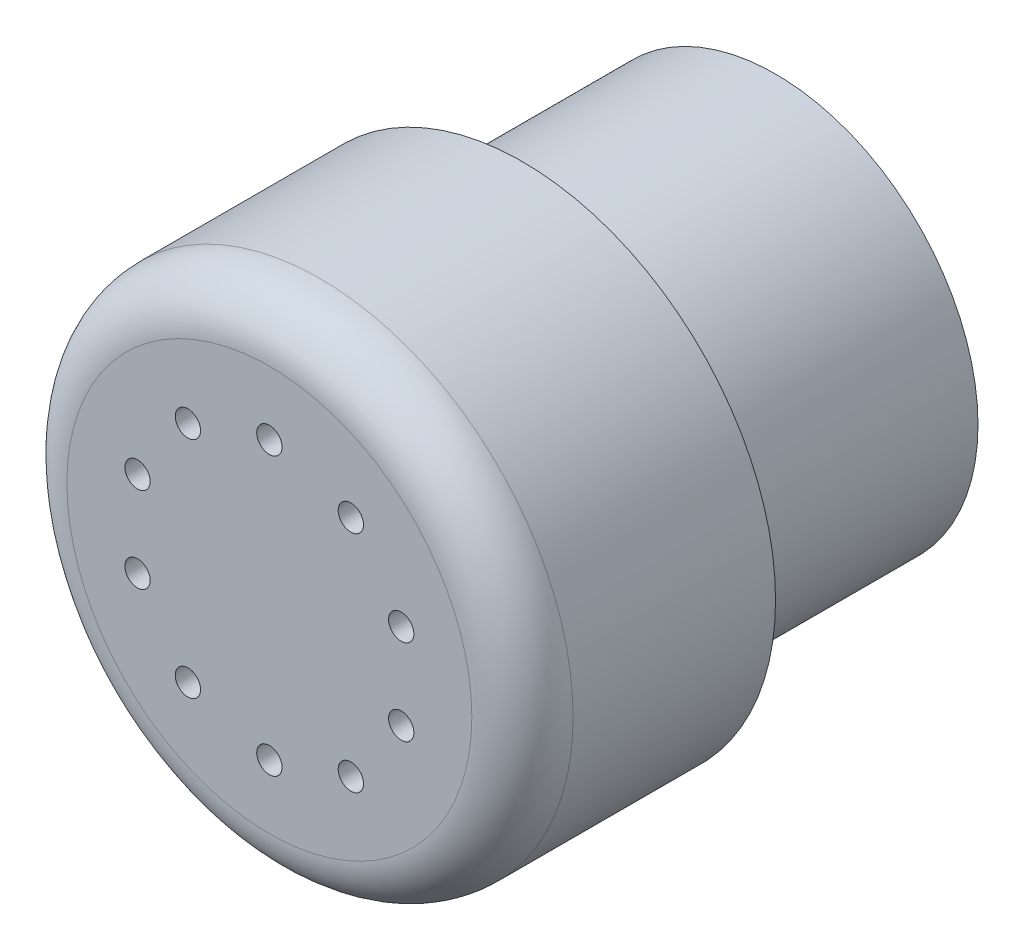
ISO-10303-21;
HEADER;
FILE_DESCRIPTION(('STEP AP214'),'2;1');
FILE_NAME('part.step','',(''),(''),'','','');
FILE_SCHEMA(('AUTOMOTIVE_DESIGN { 1 0 10303 214 1 1 1 1 }'));
ENDSEC;
DATA;
#1=APPLICATION_CONTEXT('core data for automotive mechanical design processes');
#2=APPLICATION_PROTOCOL_DEFINITION('international standard','automotive_design',2000,#1);
#3=PRODUCT_CONTEXT('',#1,'mechanical');
#4=PRODUCT('Part','Part','',(#3));
#5=PRODUCT_RELATED_PRODUCT_CATEGORY('part','',(#4));
#6=PRODUCT_DEFINITION_FORMATION('','',#4);
#7=PRODUCT_DEFINITION_CONTEXT('part definition',#1,'design');
#8=PRODUCT_DEFINITION('design','',#6,#7);
#9=PRODUCT_DEFINITION_SHAPE('','',#8);
#10=(LENGTH_UNIT() NAMED_UNIT(*) SI_UNIT(.MILLI.,.METRE.));
#11=(NAMED_UNIT(*) PLANE_ANGLE_UNIT() SI_UNIT($,.RADIAN.));
#12=(NAMED_UNIT(*) SI_UNIT($,.STERADIAN.) SOLID_ANGLE_UNIT());
#13=UNCERTAINTY_MEASURE_WITH_UNIT(LENGTH_MEASURE(1.E-05),#10,'distance_accuracy_value','');
#14=(GEOMETRIC_REPRESENTATION_CONTEXT(3) GLOBAL_UNCERTAINTY_ASSIGNED_CONTEXT((#13)) GLOBAL_UNIT_ASSIGNED_CONTEXT((#10,
#11,#12)) REPRESENTATION_CONTEXT('',''));
#15=CARTESIAN_POINT('',(0.,0.,0.));
#16=DIRECTION('',(0.,0.,1.));
#17=DIRECTION('',(1.,0.,0.));
#18=AXIS2_PLACEMENT_3D('',#15,#16,#17);
#19=CARTESIAN_POINT('',(0.,0.,0.));
#20=DIRECTION('',(0.,0.,1.));
#21=DIRECTION('',(1.,0.,0.));
#22=AXIS2_PLACEMENT_3D('',#19,#20,#21);
#23=PLANE('',#22);
#24=CARTESIAN_POINT('',(0.,0.,0.));
#25=DIRECTION('',(0.,0.,1.));
#26=DIRECTION('',(1.,0.,0.));
#27=AXIS2_PLACEMENT_3D('',#24,#25,#26);
#28=CIRCLE('',#27,10.);
#29=CARTESIAN_POINT('',(10.,0.,0.));
#30=VERTEX_POINT('',#29);
#31=EDGE_CURVE('E49',#30,#30,#28,.T.);
#32=ORIENTED_EDGE('',*,*,#31,.F.);
#33=EDGE_LOOP('',(#32));
#34=FACE_BOUND('',#33,.T.);
#35=CARTESIAN_POINT('',(0.,0.,0.));
#36=DIRECTION('',(0.,0.,1.));
#37=DIRECTION('',(1.,0.,0.));
#38=AXIS2_PLACEMENT_3D('',#35,#36,#37);
#39=CIRCLE('',#38,8.);
#40=CARTESIAN_POINT('',(8.,0.,0.));
#41=VERTEX_POINT('',#40);
#42=EDGE_CURVE('E45',#41,#41,#39,.F.);
#43=ORIENTED_EDGE('',*,*,#42,.F.);
#44=EDGE_LOOP('',(#43));
#45=FACE_BOUND('',#44,.T.);
#46=ADVANCED_FACE('F34',(#34,#45),#23,.F.);
#47=CARTESIAN_POINT('',(0.,0.,10.));
#48=DIRECTION('',(0.,0.,-1.));
#49=DIRECTION('',(-1.,0.,0.));
#50=AXIS2_PLACEMENT_3D('',#47,#48,#49);
#51=CYLINDRICAL_SURFACE('',#50,10.);
#52=CARTESIAN_POINT('',(0.,0.,8.));
#53=DIRECTION('',(0.,0.,1.));
#54=DIRECTION('',(1.,0.,0.));
#55=AXIS2_PLACEMENT_3D('',#52,#53,#54);
#56=CIRCLE('',#55,10.);
#57=CARTESIAN_POINT('',(10.,0.,8.));
#58=VERTEX_POINT('',#57);
#59=EDGE_CURVE('E10',#58,#58,#56,.F.);
#60=ORIENTED_EDGE('',*,*,#59,.T.);
#61=EDGE_LOOP('',(#60));
#62=FACE_BOUND('',#61,.T.);
#63=ORIENTED_EDGE('',*,*,#31,.T.);
#64=EDGE_LOOP('',(#63));
#65=FACE_BOUND('',#64,.T.);
#66=ADVANCED_FACE('F131',(#62,#65),#51,.T.);
#67=CARTESIAN_POINT('',(0.,0.,10.));
#68=DIRECTION('',(0.,0.,1.));
#69=DIRECTION('',(1.,0.,0.));
#70=AXIS2_PLACEMENT_3D('',#67,#68,#69);
#71=PLANE('',#70);
#72=CARTESIAN_POINT('',(-3.21979833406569,4.43167221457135,10.));
#73=DIRECTION('',(0.,0.,1.));
#74=DIRECTION('',(1.,0.,0.));
#75=AXIS2_PLACEMENT_3D('',#72,#73,#74);
#76=CIRCLE('',#75,0.5);
#77=CARTESIAN_POINT('',(-2.71979833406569,4.43167221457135,10.));
#78=VERTEX_POINT('',#77);
#79=EDGE_CURVE('E112',#78,#78,#76,.T.);
#80=ORIENTED_EDGE('',*,*,#79,.F.);
#81=EDGE_LOOP('',(#80));
#82=FACE_BOUND('',#81,.T.);
#83=CARTESIAN_POINT('',(-5.20974314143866,1.69274815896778,10.));
#84=DIRECTION('',(0.,0.,1.));
#85=DIRECTION('',(1.,0.,0.));
#86=AXIS2_PLACEMENT_3D('',#83,#84,#85);
#87=CIRCLE('',#86,0.5);
#88=CARTESIAN_POINT('',(-4.70974314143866,1.69274815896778,10.));
#89=VERTEX_POINT('',#88);
#90=EDGE_CURVE('E106',#89,#89,#87,.T.);
#91=ORIENTED_EDGE('',*,*,#90,.F.);
#92=EDGE_LOOP('',(#91));
#93=FACE_BOUND('',#92,.T.);
#94=CARTESIAN_POINT('',(-5.20974314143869,-1.69274815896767,10.));
#95=DIRECTION('',(0.,0.,1.));
#96=DIRECTION('',(1.,0.,0.));
#97=AXIS2_PLACEMENT_3D('',#94,#95,#96);
#98=CIRCLE('',#97,0.5);
#99=CARTESIAN_POINT('',(-4.70974314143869,-1.69274815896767,10.));
#100=VERTEX_POINT('',#99);
#101=EDGE_CURVE('E100',#100,#100,#98,.T.);
#102=ORIENTED_EDGE('',*,*,#101,.F.);
#103=EDGE_LOOP('',(#102));
#104=FACE_BOUND('',#103,.T.);
#105=CARTESIAN_POINT('',(-3.21979833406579,-4.43167221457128,10.));
#106=DIRECTION('',(0.,0.,1.));
#107=DIRECTION('',(1.,0.,0.));
#108=AXIS2_PLACEMENT_3D('',#105,#106,#107);
#109=CIRCLE('',#108,0.5);
#110=CARTESIAN_POINT('',(-2.71979833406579,-4.43167221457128,10.));
#111=VERTEX_POINT('',#110);
#112=EDGE_CURVE('E94',#111,#111,#109,.T.);
#113=ORIENTED_EDGE('',*,*,#112,.F.);
#114=EDGE_LOOP('',(#113));
#115=FACE_BOUND('',#114,.T.);
#116=CARTESIAN_POINT('',(0.,-5.47784811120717,10.));
#117=DIRECTION('',(0.,0.,1.));
#118=DIRECTION('',(1.,0.,0.));
#119=AXIS2_PLACEMENT_3D('',#116,#117,#118);
#120=CIRCLE('',#119,0.5);
#121=CARTESIAN_POINT('',(0.499999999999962,-5.47784811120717,10.));
#122=VERTEX_POINT('',#121);
#123=EDGE_CURVE('E88',#122,#122,#120,.T.);
#124=ORIENTED_EDGE('',*,*,#123,.F.);
#125=EDGE_LOOP('',(#124));
#126=FACE_BOUND('',#125,.T.);
#127=CARTESIAN_POINT('',(3.21979833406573,-4.43167221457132,10.));
#128=DIRECTION('',(0.,0.,1.));
#129=DIRECTION('',(1.,0.,0.));
#130=AXIS2_PLACEMENT_3D('',#127,#128,#129);
#131=CIRCLE('',#130,0.500000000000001);
#132=CARTESIAN_POINT('',(3.71979833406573,-4.43167221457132,10.));
#133=VERTEX_POINT('',#132);
#134=EDGE_CURVE('E82',#133,#133,#131,.T.);
#135=ORIENTED_EDGE('',*,*,#134,.F.);
#136=EDGE_LOOP('',(#135));
#137=FACE_BOUND('',#136,.T.);
#138=CARTESIAN_POINT('',(5.20974314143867,-1.69274815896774,10.));
#139=DIRECTION('',(0.,0.,1.));
#140=DIRECTION('',(1.,0.,0.));
#141=AXIS2_PLACEMENT_3D('',#138,#139,#140);
#142=CIRCLE('',#141,0.5);
#143=CARTESIAN_POINT('',(5.70974314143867,-1.69274815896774,10.));
#144=VERTEX_POINT('',#143);
#145=EDGE_CURVE('E76',#144,#144,#142,.T.);
#146=ORIENTED_EDGE('',*,*,#145,.F.);
#147=EDGE_LOOP('',(#146));
#148=FACE_BOUND('',#147,.T.);
#149=CARTESIAN_POINT('',(5.20974314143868,1.69274815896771,10.));
#150=DIRECTION('',(0.,0.,1.));
#151=DIRECTION('',(1.,0.,0.));
#152=AXIS2_PLACEMENT_3D('',#149,#150,#151);
#153=CIRCLE('',#152,0.500000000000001);
#154=CARTESIAN_POINT('',(5.70974314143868,1.69274815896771,10.));
#155=VERTEX_POINT('',#154);
#156=EDGE_CURVE('E70',#155,#155,#153,.T.);
#157=ORIENTED_EDGE('',*,*,#156,.F.);
#158=EDGE_LOOP('',(#157));
#159=FACE_BOUND('',#158,.T.);
#160=CARTESIAN_POINT('',(3.21979833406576,4.4316722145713,10.));
#161=DIRECTION('',(0.,0.,1.));
#162=DIRECTION('',(1.,0.,0.));
#163=AXIS2_PLACEMENT_3D('',#160,#161,#162);
#164=CIRCLE('',#163,0.5);
#165=CARTESIAN_POINT('',(3.71979833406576,4.4316722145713,10.));
#166=VERTEX_POINT('',#165);
#167=EDGE_CURVE('E64',#166,#166,#164,.T.);
#168=ORIENTED_EDGE('',*,*,#167,.F.);
#169=EDGE_LOOP('',(#168));
#170=FACE_BOUND('',#169,.T.);
#171=CARTESIAN_POINT('',(0.,5.47784811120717,10.));
#172=DIRECTION('',(0.,0.,1.));
#173=DIRECTION('',(1.,0.,0.));
#174=AXIS2_PLACEMENT_3D('',#171,#172,#173);
#175=CIRCLE('',#174,0.5);
#176=CARTESIAN_POINT('',(0.5,5.47784811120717,10.));
#177=VERTEX_POINT('',#176);
#178=EDGE_CURVE('E58',#177,#177,#175,.T.);
#179=ORIENTED_EDGE('',*,*,#178,.F.);
#180=EDGE_LOOP('',(#179));
#181=FACE_BOUND('',#180,.T.);
#182=CARTESIAN_POINT('',(0.,0.,10.));
#183=DIRECTION('',(0.,0.,1.));
#184=DIRECTION('',(1.,0.,0.));
#185=AXIS2_PLACEMENT_3D('',#182,#183,#184);
#186=CIRCLE('',#185,8.);
#187=CARTESIAN_POINT('',(8.,0.,10.));
#188=VERTEX_POINT('',#187);
#189=EDGE_CURVE('E41',#188,#188,#186,.T.);
#190=ORIENTED_EDGE('',*,*,#189,.T.);
#191=EDGE_LOOP('',(#190));
#192=FACE_BOUND('',#191,.T.);
#193=ADVANCED_FACE('F127',(#82,#93,#104,#115,#126,#137,#148,#159,#170,#181,#192),#71,.T.);
#194=CARTESIAN_POINT('',(0.,0.,-10.));
#195=DIRECTION('',(0.,0.,1.));
#196=DIRECTION('',(1.,0.,0.));
#197=AXIS2_PLACEMENT_3D('',#194,#195,#196);
#198=CYLINDRICAL_SURFACE('',#197,8.);
#199=CARTESIAN_POINT('',(0.,0.,-10.));
#200=DIRECTION('',(0.,0.,-1.));
#201=DIRECTION('',(-1.,0.,0.));
#202=AXIS2_PLACEMENT_3D('',#199,#200,#201);
#203=CIRCLE('',#202,8.);
#204=CARTESIAN_POINT('',(-8.,0.,-10.));
#205=VERTEX_POINT('',#204);
#206=EDGE_CURVE('E54',#205,#205,#203,.T.);
#207=ORIENTED_EDGE('',*,*,#206,.F.);
#208=EDGE_LOOP('',(#207));
#209=FACE_BOUND('',#208,.T.);
#210=ORIENTED_EDGE('',*,*,#42,.T.);
#211=EDGE_LOOP('',(#210));
#212=FACE_BOUND('',#211,.T.);
#213=ADVANCED_FACE('F130',(#209,#212),#198,.T.);
#214=CARTESIAN_POINT('',(0.,0.,-10.));
#215=DIRECTION('',(0.,0.,-1.));
#216=DIRECTION('',(-1.,0.,0.));
#217=AXIS2_PLACEMENT_3D('',#214,#215,#216);
#218=PLANE('',#217);
#219=ORIENTED_EDGE('',*,*,#206,.T.);
#220=EDGE_LOOP('',(#219));
#221=FACE_BOUND('',#220,.T.);
#222=ADVANCED_FACE('F163',(#221),#218,.T.);
#223=CARTESIAN_POINT('',(0.,0.,8.));
#224=DIRECTION('',(0.,0.,1.));
#225=DIRECTION('',(1.,0.,0.));
#226=AXIS2_PLACEMENT_3D('',#223,#224,#225);
#227=TOROIDAL_SURFACE('',#226,8.,2.);
#228=ORIENTED_EDGE('',*,*,#59,.F.);
#229=EDGE_LOOP('',(#228));
#230=FACE_BOUND('',#229,.T.);
#231=ORIENTED_EDGE('',*,*,#189,.F.);
#232=EDGE_LOOP('',(#231));
#233=FACE_BOUND('',#232,.T.);
#234=ADVANCED_FACE('F36',(#230,#233),#227,.T.);
#235=CARTESIAN_POINT('',(0.,5.47784811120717,9.));
#236=DIRECTION('',(0.,0.,1.));
#237=DIRECTION('',(1.,0.,0.));
#238=AXIS2_PLACEMENT_3D('',#235,#236,#237);
#239=CYLINDRICAL_SURFACE('',#238,0.5);
#240=CARTESIAN_POINT('',(0.,5.47784811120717,9.));
#241=DIRECTION('',(0.,0.,1.));
#242=DIRECTION('',(1.,0.,0.));
#243=AXIS2_PLACEMENT_3D('',#240,#241,#242);
#244=CIRCLE('',#243,0.5);
#245=CARTESIAN_POINT('',(0.5,5.47784811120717,9.));
#246=VERTEX_POINT('',#245);
#247=EDGE_CURVE('E57',#246,#246,#244,.T.);
#248=ORIENTED_EDGE('',*,*,#247,.F.);
#249=EDGE_LOOP('',(#248));
#250=FACE_BOUND('',#249,.T.);
#251=ORIENTED_EDGE('',*,*,#178,.T.);
#252=EDGE_LOOP('',(#251));
#253=FACE_BOUND('',#252,.T.);
#254=ADVANCED_FACE('F151',(#250,#253),#239,.F.);
#255=CARTESIAN_POINT('',(0.,5.47784811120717,9.));
#256=DIRECTION('',(0.,0.,1.));
#257=DIRECTION('',(1.,0.,0.));
#258=AXIS2_PLACEMENT_3D('',#255,#256,#257);
#259=PLANE('',#258);
#260=ORIENTED_EDGE('',*,*,#247,.T.);
#261=EDGE_LOOP('',(#260));
#262=FACE_BOUND('',#261,.T.);
#263=ADVANCED_FACE('F153',(#262),#259,.T.);
#264=CARTESIAN_POINT('',(3.21979833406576,4.4316722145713,9.));
#265=DIRECTION('',(0.,0.,1.));
#266=DIRECTION('',(1.,0.,0.));
#267=AXIS2_PLACEMENT_3D('',#264,#265,#266);
#268=CYLINDRICAL_SURFACE('',#267,0.5);
#269=CARTESIAN_POINT('',(3.21979833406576,4.4316722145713,9.));
#270=DIRECTION('',(0.,0.,1.));
#271=DIRECTION('',(1.,0.,0.));
#272=AXIS2_PLACEMENT_3D('',#269,#270,#271);
#273=CIRCLE('',#272,0.5);
#274=CARTESIAN_POINT('',(3.71979833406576,4.4316722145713,9.));
#275=VERTEX_POINT('',#274);
#276=EDGE_CURVE('E61',#275,#275,#273,.T.);
#277=ORIENTED_EDGE('',*,*,#276,.F.);
#278=EDGE_LOOP('',(#277));
#279=FACE_BOUND('',#278,.T.);
#280=ORIENTED_EDGE('',*,*,#167,.T.);
#281=EDGE_LOOP('',(#280));
#282=FACE_BOUND('',#281,.T.);
#283=ADVANCED_FACE('F160',(#279,#282),#268,.F.);
#284=CARTESIAN_POINT('',(3.21979833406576,4.4316722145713,9.));
#285=DIRECTION('',(0.,0.,1.));
#286=DIRECTION('',(1.,0.,0.));
#287=AXIS2_PLACEMENT_3D('',#284,#285,#286);
#288=PLANE('',#287);
#289=ORIENTED_EDGE('',*,*,#276,.T.);
#290=EDGE_LOOP('',(#289));
#291=FACE_BOUND('',#290,.T.);
#292=ADVANCED_FACE('F220',(#291),#288,.T.);
#293=CARTESIAN_POINT('',(5.20974314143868,1.69274815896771,9.));
#294=DIRECTION('',(0.,0.,1.));
#295=DIRECTION('',(1.,0.,0.));
#296=AXIS2_PLACEMENT_3D('',#293,#294,#295);
#297=CYLINDRICAL_SURFACE('',#296,0.500000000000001);
#298=CARTESIAN_POINT('',(5.20974314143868,1.69274815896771,9.));
#299=DIRECTION('',(0.,0.,1.));
#300=DIRECTION('',(1.,0.,0.));
#301=AXIS2_PLACEMENT_3D('',#298,#299,#300);
#302=CIRCLE('',#301,0.500000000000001);
#303=CARTESIAN_POINT('',(5.70974314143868,1.69274815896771,9.));
#304=VERTEX_POINT('',#303);
#305=EDGE_CURVE('E67',#304,#304,#302,.T.);
#306=ORIENTED_EDGE('',*,*,#305,.F.);
#307=EDGE_LOOP('',(#306));
#308=FACE_BOUND('',#307,.T.);
#309=ORIENTED_EDGE('',*,*,#156,.T.);
#310=EDGE_LOOP('',(#309));
#311=FACE_BOUND('',#310,.T.);
#312=ADVANCED_FACE('F230',(#308,#311),#297,.F.);
#313=CARTESIAN_POINT('',(5.20974314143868,1.69274815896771,9.));
#314=DIRECTION('',(0.,0.,1.));
#315=DIRECTION('',(1.,0.,0.));
#316=AXIS2_PLACEMENT_3D('',#313,#314,#315);
#317=PLANE('',#316);
#318=ORIENTED_EDGE('',*,*,#305,.T.);
#319=EDGE_LOOP('',(#318));
#320=FACE_BOUND('',#319,.T.);
#321=ADVANCED_FACE('F240',(#320),#317,.T.);
#322=CARTESIAN_POINT('',(5.20974314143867,-1.69274815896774,9.));
#323=DIRECTION('',(0.,0.,1.));
#324=DIRECTION('',(1.,0.,0.));
#325=AXIS2_PLACEMENT_3D('',#322,#323,#324);
#326=CYLINDRICAL_SURFACE('',#325,0.5);
#327=CARTESIAN_POINT('',(5.20974314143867,-1.69274815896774,9.));
#328=DIRECTION('',(0.,0.,1.));
#329=DIRECTION('',(1.,0.,0.));
#330=AXIS2_PLACEMENT_3D('',#327,#328,#329);
#331=CIRCLE('',#330,0.5);
#332=CARTESIAN_POINT('',(5.70974314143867,-1.69274815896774,9.));
#333=VERTEX_POINT('',#332);
#334=EDGE_CURVE('E73',#333,#333,#331,.T.);
#335=ORIENTED_EDGE('',*,*,#334,.F.);
#336=EDGE_LOOP('',(#335));
#337=FACE_BOUND('',#336,.T.);
#338=ORIENTED_EDGE('',*,*,#145,.T.);
#339=EDGE_LOOP('',(#338));
#340=FACE_BOUND('',#339,.T.);
#341=ADVANCED_FACE('F250',(#337,#340),#326,.F.);
#342=CARTESIAN_POINT('',(5.20974314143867,-1.69274815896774,9.));
#343=DIRECTION('',(0.,0.,1.));
#344=DIRECTION('',(1.,0.,0.));
#345=AXIS2_PLACEMENT_3D('',#342,#343,#344);
#346=PLANE('',#345);
#347=ORIENTED_EDGE('',*,*,#334,.T.);
#348=EDGE_LOOP('',(#347));
#349=FACE_BOUND('',#348,.T.);
#350=ADVANCED_FACE('F260',(#349),#346,.T.);
#351=CARTESIAN_POINT('',(3.21979833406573,-4.43167221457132,9.));
#352=DIRECTION('',(0.,0.,1.));
#353=DIRECTION('',(1.,0.,0.));
#354=AXIS2_PLACEMENT_3D('',#351,#352,#353);
#355=CYLINDRICAL_SURFACE('',#354,0.500000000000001);
#356=CARTESIAN_POINT('',(3.21979833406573,-4.43167221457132,9.));
#357=DIRECTION('',(0.,0.,1.));
#358=DIRECTION('',(1.,0.,0.));
#359=AXIS2_PLACEMENT_3D('',#356,#357,#358);
#360=CIRCLE('',#359,0.500000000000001);
#361=CARTESIAN_POINT('',(3.71979833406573,-4.43167221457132,9.));
#362=VERTEX_POINT('',#361);
#363=EDGE_CURVE('E79',#362,#362,#360,.T.);
#364=ORIENTED_EDGE('',*,*,#363,.F.);
#365=EDGE_LOOP('',(#364));
#366=FACE_BOUND('',#365,.T.);
#367=ORIENTED_EDGE('',*,*,#134,.T.);
#368=EDGE_LOOP('',(#367));
#369=FACE_BOUND('',#368,.T.);
#370=ADVANCED_FACE('F270',(#366,#369),#355,.F.);
#371=CARTESIAN_POINT('',(3.21979833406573,-4.43167221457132,9.));
#372=DIRECTION('',(0.,0.,1.));
#373=DIRECTION('',(1.,0.,0.));
#374=AXIS2_PLACEMENT_3D('',#371,#372,#373);
#375=PLANE('',#374);
#376=ORIENTED_EDGE('',*,*,#363,.T.);
#377=EDGE_LOOP('',(#376));
#378=FACE_BOUND('',#377,.T.);
#379=ADVANCED_FACE('F280',(#378),#375,.T.);
#380=CARTESIAN_POINT('',(0.,-5.47784811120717,9.));
#381=DIRECTION('',(0.,0.,1.));
#382=DIRECTION('',(1.,0.,0.));
#383=AXIS2_PLACEMENT_3D('',#380,#381,#382);
#384=CYLINDRICAL_SURFACE('',#383,0.5);
#385=CARTESIAN_POINT('',(0.,-5.47784811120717,9.));
#386=DIRECTION('',(0.,0.,1.));
#387=DIRECTION('',(1.,0.,0.));
#388=AXIS2_PLACEMENT_3D('',#385,#386,#387);
#389=CIRCLE('',#388,0.5);
#390=CARTESIAN_POINT('',(0.499999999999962,-5.47784811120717,9.));
#391=VERTEX_POINT('',#390);
#392=EDGE_CURVE('E85',#391,#391,#389,.T.);
#393=ORIENTED_EDGE('',*,*,#392,.F.);
#394=EDGE_LOOP('',(#393));
#395=FACE_BOUND('',#394,.T.);
#396=ORIENTED_EDGE('',*,*,#123,.T.);
#397=EDGE_LOOP('',(#396));
#398=FACE_BOUND('',#397,.T.);
#399=ADVANCED_FACE('F290',(#395,#398),#384,.F.);
#400=CARTESIAN_POINT('',(0.,-5.47784811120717,9.));
#401=DIRECTION('',(0.,0.,1.));
#402=DIRECTION('',(1.,0.,0.));
#403=AXIS2_PLACEMENT_3D('',#400,#401,#402);
#404=PLANE('',#403);
#405=ORIENTED_EDGE('',*,*,#392,.T.);
#406=EDGE_LOOP('',(#405));
#407=FACE_BOUND('',#406,.T.);
#408=ADVANCED_FACE('F300',(#407),#404,.T.);
#409=CARTESIAN_POINT('',(-3.21979833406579,-4.43167221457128,9.));
#410=DIRECTION('',(0.,0.,1.));
#411=DIRECTION('',(1.,0.,0.));
#412=AXIS2_PLACEMENT_3D('',#409,#410,#411);
#413=CYLINDRICAL_SURFACE('',#412,0.5);
#414=CARTESIAN_POINT('',(-3.21979833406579,-4.43167221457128,9.));
#415=DIRECTION('',(0.,0.,1.));
#416=DIRECTION('',(1.,0.,0.));
#417=AXIS2_PLACEMENT_3D('',#414,#415,#416);
#418=CIRCLE('',#417,0.5);
#419=CARTESIAN_POINT('',(-2.71979833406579,-4.43167221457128,9.));
#420=VERTEX_POINT('',#419);
#421=EDGE_CURVE('E91',#420,#420,#418,.T.);
#422=ORIENTED_EDGE('',*,*,#421,.F.);
#423=EDGE_LOOP('',(#422));
#424=FACE_BOUND('',#423,.T.);
#425=ORIENTED_EDGE('',*,*,#112,.T.);
#426=EDGE_LOOP('',(#425));
#427=FACE_BOUND('',#426,.T.);
#428=ADVANCED_FACE('F310',(#424,#427),#413,.F.);
#429=CARTESIAN_POINT('',(-3.21979833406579,-4.43167221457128,9.));
#430=DIRECTION('',(0.,0.,1.));
#431=DIRECTION('',(1.,0.,0.));
#432=AXIS2_PLACEMENT_3D('',#429,#430,#431);
#433=PLANE('',#432);
#434=ORIENTED_EDGE('',*,*,#421,.T.);
#435=EDGE_LOOP('',(#434));
#436=FACE_BOUND('',#435,.T.);
#437=ADVANCED_FACE('F320',(#436),#433,.T.);
#438=CARTESIAN_POINT('',(-5.20974314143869,-1.69274815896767,9.));
#439=DIRECTION('',(0.,0.,1.));
#440=DIRECTION('',(1.,0.,0.));
#441=AXIS2_PLACEMENT_3D('',#438,#439,#440);
#442=CYLINDRICAL_SURFACE('',#441,0.5);
#443=CARTESIAN_POINT('',(-5.20974314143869,-1.69274815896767,9.));
#444=DIRECTION('',(0.,0.,1.));
#445=DIRECTION('',(1.,0.,0.));
#446=AXIS2_PLACEMENT_3D('',#443,#444,#445);
#447=CIRCLE('',#446,0.5);
#448=CARTESIAN_POINT('',(-4.70974314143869,-1.69274815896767,9.));
#449=VERTEX_POINT('',#448);
#450=EDGE_CURVE('E97',#449,#449,#447,.T.);
#451=ORIENTED_EDGE('',*,*,#450,.F.);
#452=EDGE_LOOP('',(#451));
#453=FACE_BOUND('',#452,.T.);
#454=ORIENTED_EDGE('',*,*,#101,.T.);
#455=EDGE_LOOP('',(#454));
#456=FACE_BOUND('',#455,.T.);
#457=ADVANCED_FACE('F330',(#453,#456),#442,.F.);
#458=CARTESIAN_POINT('',(-5.20974314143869,-1.69274815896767,9.));
#459=DIRECTION('',(0.,0.,1.));
#460=DIRECTION('',(1.,0.,0.));
#461=AXIS2_PLACEMENT_3D('',#458,#459,#460);
#462=PLANE('',#461);
#463=ORIENTED_EDGE('',*,*,#450,.T.);
#464=EDGE_LOOP('',(#463));
#465=FACE_BOUND('',#464,.T.);
#466=ADVANCED_FACE('F340',(#465),#462,.T.);
#467=CARTESIAN_POINT('',(-5.20974314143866,1.69274815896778,9.));
#468=DIRECTION('',(0.,0.,1.));
#469=DIRECTION('',(1.,0.,0.));
#470=AXIS2_PLACEMENT_3D('',#467,#468,#469);
#471=CYLINDRICAL_SURFACE('',#470,0.5);
#472=CARTESIAN_POINT('',(-5.20974314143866,1.69274815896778,9.));
#473=DIRECTION('',(0.,0.,1.));
#474=DIRECTION('',(1.,0.,0.));
#475=AXIS2_PLACEMENT_3D('',#472,#473,#474);
#476=CIRCLE('',#475,0.5);
#477=CARTESIAN_POINT('',(-4.70974314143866,1.69274815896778,9.));
#478=VERTEX_POINT('',#477);
#479=EDGE_CURVE('E103',#478,#478,#476,.T.);
#480=ORIENTED_EDGE('',*,*,#479,.F.);
#481=EDGE_LOOP('',(#480));
#482=FACE_BOUND('',#481,.T.);
#483=ORIENTED_EDGE('',*,*,#90,.T.);
#484=EDGE_LOOP('',(#483));
#485=FACE_BOUND('',#484,.T.);
#486=ADVANCED_FACE('F350',(#482,#485),#471,.F.);
#487=CARTESIAN_POINT('',(-5.20974314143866,1.69274815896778,9.));
#488=DIRECTION('',(0.,0.,1.));
#489=DIRECTION('',(1.,0.,0.));
#490=AXIS2_PLACEMENT_3D('',#487,#488,#489);
#491=PLANE('',#490);
#492=ORIENTED_EDGE('',*,*,#479,.T.);
#493=EDGE_LOOP('',(#492));
#494=FACE_BOUND('',#493,.T.);
#495=ADVANCED_FACE('F123',(#494),#491,.T.);
#496=CARTESIAN_POINT('',(-3.21979833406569,4.43167221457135,9.));
#497=DIRECTION('',(0.,0.,1.));
#498=DIRECTION('',(1.,0.,0.));
#499=AXIS2_PLACEMENT_3D('',#496,#497,#498);
#500=CYLINDRICAL_SURFACE('',#499,0.5);
#501=CARTESIAN_POINT('',(-3.21979833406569,4.43167221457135,9.));
#502=DIRECTION('',(0.,0.,1.));
#503=DIRECTION('',(1.,0.,0.));
#504=AXIS2_PLACEMENT_3D('',#501,#502,#503);
#505=CIRCLE('',#504,0.5);
#506=CARTESIAN_POINT('',(-2.71979833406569,4.43167221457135,9.));
#507=VERTEX_POINT('',#506);
#508=EDGE_CURVE('E109',#507,#507,#505,.T.);
#509=ORIENTED_EDGE('',*,*,#508,.F.);
#510=EDGE_LOOP('',(#509));
#511=FACE_BOUND('',#510,.T.);
#512=ORIENTED_EDGE('',*,*,#79,.T.);
#513=EDGE_LOOP('',(#512));
#514=FACE_BOUND('',#513,.T.);
#515=ADVANCED_FACE('F120',(#511,#514),#500,.F.);
#516=CARTESIAN_POINT('',(-3.21979833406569,4.43167221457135,9.));
#517=DIRECTION('',(0.,0.,1.));
#518=DIRECTION('',(1.,0.,0.));
#519=AXIS2_PLACEMENT_3D('',#516,#517,#518);
#520=PLANE('',#519);
#521=ORIENTED_EDGE('',*,*,#508,.T.);
#522=EDGE_LOOP('',(#521));
#523=FACE_BOUND('',#522,.T.);
#524=ADVANCED_FACE('F118',(#523),#520,.T.);
#525=CLOSED_SHELL('',(#46,#66,#193,#213,#222,#234,#254,#263,#283,#292,#312,#321,#341,#350,#370,
#379,#399,#408,#428,#437,#457,#466,#486,#495,#515,#524));
#526=MANIFOLD_SOLID_BREP('B2',#525);
#527=ADVANCED_BREP_SHAPE_REPRESENTATION('',(#18,#526),#14);
#528=SHAPE_DEFINITION_REPRESENTATION(#9,#527);
ENDSEC;
END-ISO-10303-21;
